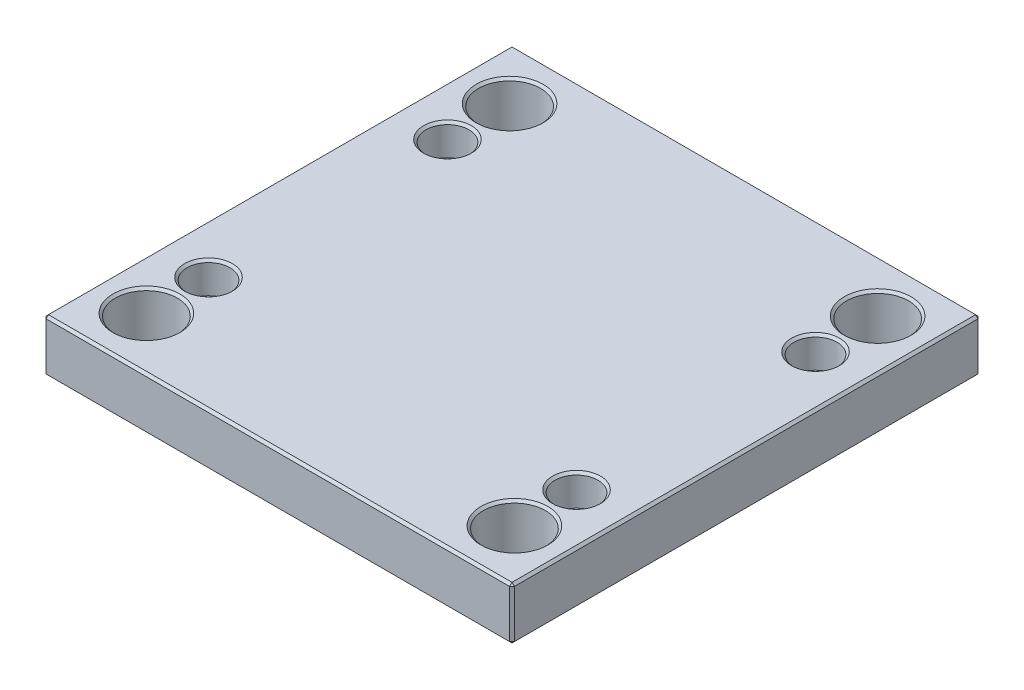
ISO-10303-21;
HEADER;
FILE_DESCRIPTION(('STEP AP214'),'2;1');
FILE_NAME('part.step','',(''),(''),'','','');
FILE_SCHEMA(('AUTOMOTIVE_DESIGN { 1 0 10303 214 1 1 1 1 }'));
ENDSEC;
DATA;
#1=APPLICATION_CONTEXT('core data for automotive mechanical design processes');
#2=APPLICATION_PROTOCOL_DEFINITION('international standard','automotive_design',2000,#1);
#3=PRODUCT_CONTEXT('',#1,'mechanical');
#4=PRODUCT('Part','Part','',(#3));
#5=PRODUCT_RELATED_PRODUCT_CATEGORY('part','',(#4));
#6=PRODUCT_DEFINITION_FORMATION('','',#4);
#7=PRODUCT_DEFINITION_CONTEXT('part definition',#1,'design');
#8=PRODUCT_DEFINITION('design','',#6,#7);
#9=PRODUCT_DEFINITION_SHAPE('','',#8);
#10=(LENGTH_UNIT() NAMED_UNIT(*) SI_UNIT(.MILLI.,.METRE.));
#11=(NAMED_UNIT(*) PLANE_ANGLE_UNIT() SI_UNIT($,.RADIAN.));
#12=(NAMED_UNIT(*) SI_UNIT($,.STERADIAN.) SOLID_ANGLE_UNIT());
#13=UNCERTAINTY_MEASURE_WITH_UNIT(LENGTH_MEASURE(1.E-05),#10,'distance_accuracy_value','');
#14=(GEOMETRIC_REPRESENTATION_CONTEXT(3) GLOBAL_UNCERTAINTY_ASSIGNED_CONTEXT((#13)) GLOBAL_UNIT_ASSIGNED_CONTEXT((#10,
#11,#12)) REPRESENTATION_CONTEXT('',''));
#15=CARTESIAN_POINT('',(0.,0.,0.));
#16=DIRECTION('',(0.,0.,1.));
#17=DIRECTION('',(1.,0.,0.));
#18=AXIS2_PLACEMENT_3D('',#15,#16,#17);
#19=CARTESIAN_POINT('',(-98.,22.,98.));
#20=DIRECTION('',(1.,0.,0.));
#21=DIRECTION('',(0.,0.,-1.));
#22=AXIS2_PLACEMENT_3D('',#19,#20,#21);
#23=PLANE('',#22);
#24=DIRECTION('',(0.,-1.,0.));
#25=VECTOR('',#24,1.);
#26=CARTESIAN_POINT('',(-98.,22.,-97.));
#27=LINE('',#26,#25);
#28=CARTESIAN_POINT('',(-98.,21.,-97.));
#29=VERTEX_POINT('',#28);
#30=CARTESIAN_POINT('',(-98.,1.00000000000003,-97.));
#31=VERTEX_POINT('',#30);
#32=EDGE_CURVE('E114',#29,#31,#27,.T.);
#33=ORIENTED_EDGE('',*,*,#32,.T.);
#34=DIRECTION('',(0.,0.,1.));
#35=VECTOR('',#34,1.);
#36=CARTESIAN_POINT('',(-98.,1.00000000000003,98.));
#37=LINE('',#36,#35);
#38=CARTESIAN_POINT('',(-98.,1.00000000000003,97.));
#39=VERTEX_POINT('',#38);
#40=EDGE_CURVE('E110',#31,#39,#37,.T.);
#41=ORIENTED_EDGE('',*,*,#40,.T.);
#42=DIRECTION('',(0.,1.,0.));
#43=VECTOR('',#42,1.);
#44=CARTESIAN_POINT('',(-98.,22.,97.));
#45=LINE('',#44,#43);
#46=CARTESIAN_POINT('',(-98.,21.,97.));
#47=VERTEX_POINT('',#46);
#48=EDGE_CURVE('E103',#39,#47,#45,.T.);
#49=ORIENTED_EDGE('',*,*,#48,.T.);
#50=DIRECTION('',(0.,0.,-1.));
#51=VECTOR('',#50,1.);
#52=CARTESIAN_POINT('',(-98.,21.,-98.));
#53=LINE('',#52,#51);
#54=EDGE_CURVE('E107',#47,#29,#53,.T.);
#55=ORIENTED_EDGE('',*,*,#54,.T.);
#56=EDGE_LOOP('',(#33,#41,#49,#55));
#57=FACE_BOUND('',#56,.T.);
#58=ADVANCED_FACE('F15',(#57),#23,.F.);
#59=CARTESIAN_POINT('',(98.,22.,98.));
#60=DIRECTION('',(0.,0.,-1.));
#61=DIRECTION('',(-1.,0.,0.));
#62=AXIS2_PLACEMENT_3D('',#59,#60,#61);
#63=PLANE('',#62);
#64=DIRECTION('',(-1.,0.,0.));
#65=VECTOR('',#64,1.);
#66=CARTESIAN_POINT('',(-98.,21.,98.));
#67=LINE('',#66,#65);
#68=CARTESIAN_POINT('',(97.,21.,98.));
#69=VERTEX_POINT('',#68);
#70=CARTESIAN_POINT('',(-97.,21.,98.));
#71=VERTEX_POINT('',#70);
#72=EDGE_CURVE('E169',#69,#71,#67,.T.);
#73=ORIENTED_EDGE('',*,*,#72,.T.);
#74=DIRECTION('',(0.,-1.,0.));
#75=VECTOR('',#74,1.);
#76=CARTESIAN_POINT('',(-97.,22.,98.));
#77=LINE('',#76,#75);
#78=CARTESIAN_POINT('',(-97.,1.00000000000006,98.));
#79=VERTEX_POINT('',#78);
#80=EDGE_CURVE('E122',#71,#79,#77,.T.);
#81=ORIENTED_EDGE('',*,*,#80,.T.);
#82=DIRECTION('',(1.,0.,0.));
#83=VECTOR('',#82,1.);
#84=CARTESIAN_POINT('',(98.,1.00000000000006,98.));
#85=LINE('',#84,#83);
#86=CARTESIAN_POINT('',(97.,1.00000000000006,98.));
#87=VERTEX_POINT('',#86);
#88=EDGE_CURVE('E173',#79,#87,#85,.T.);
#89=ORIENTED_EDGE('',*,*,#88,.T.);
#90=DIRECTION('',(0.,1.,0.));
#91=VECTOR('',#90,1.);
#92=CARTESIAN_POINT('',(97.,22.,98.));
#93=LINE('',#92,#91);
#94=EDGE_CURVE('E171',#87,#69,#93,.T.);
#95=ORIENTED_EDGE('',*,*,#94,.T.);
#96=EDGE_LOOP('',(#73,#81,#89,#95));
#97=FACE_BOUND('',#96,.T.);
#98=ADVANCED_FACE('F412',(#97),#63,.F.);
#99=CARTESIAN_POINT('',(98.,22.,98.));
#100=DIRECTION('',(-1.,0.,0.));
#101=DIRECTION('',(0.,0.,1.));
#102=AXIS2_PLACEMENT_3D('',#99,#100,#101);
#103=PLANE('',#102);
#104=DIRECTION('',(0.,0.,-1.));
#105=VECTOR('',#104,1.);
#106=CARTESIAN_POINT('',(98.,1.00000000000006,98.));
#107=LINE('',#106,#105);
#108=CARTESIAN_POINT('',(98.,1.00000000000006,97.));
#109=VERTEX_POINT('',#108);
#110=CARTESIAN_POINT('',(98.,1.00000000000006,-97.));
#111=VERTEX_POINT('',#110);
#112=EDGE_CURVE('E164',#109,#111,#107,.T.);
#113=ORIENTED_EDGE('',*,*,#112,.T.);
#114=DIRECTION('',(0.,1.,0.));
#115=VECTOR('',#114,1.);
#116=CARTESIAN_POINT('',(98.,22.,-97.));
#117=LINE('',#116,#115);
#118=CARTESIAN_POINT('',(98.,21.,-97.));
#119=VERTEX_POINT('',#118);
#120=EDGE_CURVE('E166',#111,#119,#117,.T.);
#121=ORIENTED_EDGE('',*,*,#120,.T.);
#122=DIRECTION('',(0.,0.,1.));
#123=VECTOR('',#122,1.);
#124=CARTESIAN_POINT('',(98.,21.,98.));
#125=LINE('',#124,#123);
#126=CARTESIAN_POINT('',(98.,21.,97.));
#127=VERTEX_POINT('',#126);
#128=EDGE_CURVE('E160',#119,#127,#125,.T.);
#129=ORIENTED_EDGE('',*,*,#128,.T.);
#130=DIRECTION('',(0.,-1.,0.));
#131=VECTOR('',#130,1.);
#132=CARTESIAN_POINT('',(98.,22.,97.));
#133=LINE('',#132,#131);
#134=EDGE_CURVE('E162',#127,#109,#133,.T.);
#135=ORIENTED_EDGE('',*,*,#134,.T.);
#136=EDGE_LOOP('',(#113,#121,#129,#135));
#137=FACE_BOUND('',#136,.T.);
#138=ADVANCED_FACE('F405',(#137),#103,.F.);
#139=CARTESIAN_POINT('',(98.,22.,-98.));
#140=DIRECTION('',(0.,0.,1.));
#141=DIRECTION('',(1.,0.,0.));
#142=AXIS2_PLACEMENT_3D('',#139,#140,#141);
#143=PLANE('',#142);
#144=DIRECTION('',(0.,-1.,0.));
#145=VECTOR('',#144,1.);
#146=CARTESIAN_POINT('',(97.,22.,-98.));
#147=LINE('',#146,#145);
#148=CARTESIAN_POINT('',(97.,21.,-98.));
#149=VERTEX_POINT('',#148);
#150=CARTESIAN_POINT('',(97.,1.00000000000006,-98.));
#151=VERTEX_POINT('',#150);
#152=EDGE_CURVE('E153',#149,#151,#147,.T.);
#153=ORIENTED_EDGE('',*,*,#152,.T.);
#154=DIRECTION('',(-1.,0.,0.));
#155=VECTOR('',#154,1.);
#156=CARTESIAN_POINT('',(98.,1.00000000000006,-98.));
#157=LINE('',#156,#155);
#158=CARTESIAN_POINT('',(-97.,1.00000000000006,-98.));
#159=VERTEX_POINT('',#158);
#160=EDGE_CURVE('E158',#151,#159,#157,.T.);
#161=ORIENTED_EDGE('',*,*,#160,.T.);
#162=DIRECTION('',(0.,1.,0.));
#163=VECTOR('',#162,1.);
#164=CARTESIAN_POINT('',(-97.,22.,-98.));
#165=LINE('',#164,#163);
#166=CARTESIAN_POINT('',(-97.,21.,-98.));
#167=VERTEX_POINT('',#166);
#168=EDGE_CURVE('E155',#159,#167,#165,.T.);
#169=ORIENTED_EDGE('',*,*,#168,.T.);
#170=DIRECTION('',(1.,0.,0.));
#171=VECTOR('',#170,1.);
#172=CARTESIAN_POINT('',(98.,21.,-98.));
#173=LINE('',#172,#171);
#174=EDGE_CURVE('E151',#167,#149,#173,.T.);
#175=ORIENTED_EDGE('',*,*,#174,.T.);
#176=EDGE_LOOP('',(#153,#161,#169,#175));
#177=FACE_BOUND('',#176,.T.);
#178=ADVANCED_FACE('F430',(#177),#143,.F.);
#179=CARTESIAN_POINT('',(0.,22.,0.));
#180=DIRECTION('',(0.,1.,0.));
#181=DIRECTION('',(0.,0.,1.));
#182=AXIS2_PLACEMENT_3D('',#179,#180,#181);
#183=PLANE('',#182);
#184=CARTESIAN_POINT('',(-77.,22.,76.));
#185=DIRECTION('',(0.,1.,0.));
#186=DIRECTION('',(0.,0.,1.));
#187=AXIS2_PLACEMENT_3D('',#184,#185,#186);
#188=CIRCLE('',#187,14.);
#189=CARTESIAN_POINT('',(-77.,22.,90.));
#190=VERTEX_POINT('',#189);
#191=EDGE_CURVE('E316',#190,#190,#188,.F.);
#192=ORIENTED_EDGE('',*,*,#191,.T.);
#193=EDGE_LOOP('',(#192));
#194=FACE_BOUND('',#193,.T.);
#195=CARTESIAN_POINT('',(77.,22.,76.));
#196=DIRECTION('',(0.,1.,0.));
#197=DIRECTION('',(0.,0.,1.));
#198=AXIS2_PLACEMENT_3D('',#195,#196,#197);
#199=CIRCLE('',#198,14.);
#200=CARTESIAN_POINT('',(77.,22.,90.));
#201=VERTEX_POINT('',#200);
#202=EDGE_CURVE('E313',#201,#201,#199,.F.);
#203=ORIENTED_EDGE('',*,*,#202,.T.);
#204=EDGE_LOOP('',(#203));
#205=FACE_BOUND('',#204,.T.);
#206=CARTESIAN_POINT('',(77.,22.,-76.));
#207=DIRECTION('',(0.,1.,0.));
#208=DIRECTION('',(0.,0.,1.));
#209=AXIS2_PLACEMENT_3D('',#206,#207,#208);
#210=CIRCLE('',#209,14.);
#211=CARTESIAN_POINT('',(77.,22.,-62.));
#212=VERTEX_POINT('',#211);
#213=EDGE_CURVE('E310',#212,#212,#210,.F.);
#214=ORIENTED_EDGE('',*,*,#213,.T.);
#215=EDGE_LOOP('',(#214));
#216=FACE_BOUND('',#215,.T.);
#217=CARTESIAN_POINT('',(-77.,22.,-76.));
#218=DIRECTION('',(0.,1.,0.));
#219=DIRECTION('',(0.,0.,1.));
#220=AXIS2_PLACEMENT_3D('',#217,#218,#219);
#221=CIRCLE('',#220,14.);
#222=CARTESIAN_POINT('',(-77.,22.,-62.));
#223=VERTEX_POINT('',#222);
#224=EDGE_CURVE('E307',#223,#223,#221,.F.);
#225=ORIENTED_EDGE('',*,*,#224,.T.);
#226=EDGE_LOOP('',(#225));
#227=FACE_BOUND('',#226,.T.);
#228=CARTESIAN_POINT('',(-77.,22.,50.));
#229=DIRECTION('',(0.,1.,0.));
#230=DIRECTION('',(0.,0.,1.));
#231=AXIS2_PLACEMENT_3D('',#228,#229,#230);
#232=CIRCLE('',#231,10.);
#233=CARTESIAN_POINT('',(-77.,22.,60.));
#234=VERTEX_POINT('',#233);
#235=EDGE_CURVE('E289',#234,#234,#232,.F.);
#236=ORIENTED_EDGE('',*,*,#235,.T.);
#237=EDGE_LOOP('',(#236));
#238=FACE_BOUND('',#237,.T.);
#239=CARTESIAN_POINT('',(77.,22.,50.));
#240=DIRECTION('',(0.,1.,0.));
#241=DIRECTION('',(0.,0.,1.));
#242=AXIS2_PLACEMENT_3D('',#239,#240,#241);
#243=CIRCLE('',#242,10.);
#244=CARTESIAN_POINT('',(77.,22.,60.));
#245=VERTEX_POINT('',#244);
#246=EDGE_CURVE('E286',#245,#245,#243,.F.);
#247=ORIENTED_EDGE('',*,*,#246,.T.);
#248=EDGE_LOOP('',(#247));
#249=FACE_BOUND('',#248,.T.);
#250=CARTESIAN_POINT('',(77.,22.,-50.));
#251=DIRECTION('',(0.,1.,0.));
#252=DIRECTION('',(0.,0.,1.));
#253=AXIS2_PLACEMENT_3D('',#250,#251,#252);
#254=CIRCLE('',#253,10.);
#255=CARTESIAN_POINT('',(77.,22.,-40.));
#256=VERTEX_POINT('',#255);
#257=EDGE_CURVE('E283',#256,#256,#254,.F.);
#258=ORIENTED_EDGE('',*,*,#257,.T.);
#259=EDGE_LOOP('',(#258));
#260=FACE_BOUND('',#259,.T.);
#261=CARTESIAN_POINT('',(-77.,22.,-50.));
#262=DIRECTION('',(0.,1.,0.));
#263=DIRECTION('',(0.,0.,1.));
#264=AXIS2_PLACEMENT_3D('',#261,#262,#263);
#265=CIRCLE('',#264,10.);
#266=CARTESIAN_POINT('',(-77.,22.,-40.));
#267=VERTEX_POINT('',#266);
#268=EDGE_CURVE('E280',#267,#267,#265,.F.);
#269=ORIENTED_EDGE('',*,*,#268,.T.);
#270=EDGE_LOOP('',(#269));
#271=FACE_BOUND('',#270,.T.);
#272=DIRECTION('',(0.,0.,-1.));
#273=VECTOR('',#272,1.);
#274=CARTESIAN_POINT('',(97.,22.,-98.));
#275=LINE('',#274,#273);
#276=CARTESIAN_POINT('',(97.,22.,97.));
#277=VERTEX_POINT('',#276);
#278=CARTESIAN_POINT('',(97.,22.,-97.));
#279=VERTEX_POINT('',#278);
#280=EDGE_CURVE('E30',#277,#279,#275,.T.);
#281=ORIENTED_EDGE('',*,*,#280,.T.);
#282=DIRECTION('',(-1.,0.,0.));
#283=VECTOR('',#282,1.);
#284=CARTESIAN_POINT('',(-98.,22.,-97.));
#285=LINE('',#284,#283);
#286=CARTESIAN_POINT('',(-97.,22.,-97.));
#287=VERTEX_POINT('',#286);
#288=EDGE_CURVE('E189',#279,#287,#285,.T.);
#289=ORIENTED_EDGE('',*,*,#288,.T.);
#290=DIRECTION('',(0.,0.,1.));
#291=VECTOR('',#290,1.);
#292=CARTESIAN_POINT('',(-97.,22.,98.));
#293=LINE('',#292,#291);
#294=CARTESIAN_POINT('',(-97.,22.,97.));
#295=VERTEX_POINT('',#294);
#296=EDGE_CURVE('E185',#287,#295,#293,.T.);
#297=ORIENTED_EDGE('',*,*,#296,.T.);
#298=DIRECTION('',(1.,0.,0.));
#299=VECTOR('',#298,1.);
#300=CARTESIAN_POINT('',(98.,22.,97.));
#301=LINE('',#300,#299);
#302=EDGE_CURVE('E35',#295,#277,#301,.T.);
#303=ORIENTED_EDGE('',*,*,#302,.T.);
#304=EDGE_LOOP('',(#281,#289,#297,#303));
#305=FACE_BOUND('',#304,.T.);
#306=ADVANCED_FACE('F356',(#194,#205,#216,#227,#238,#249,#260,#271,#305),#183,.T.);
#307=CARTESIAN_POINT('',(0.,0.,0.));
#308=DIRECTION('',(0.,1.,0.));
#309=DIRECTION('',(0.,0.,1.));
#310=AXIS2_PLACEMENT_3D('',#307,#308,#309);
#311=PLANE('',#310);
#312=CARTESIAN_POINT('',(-77.,0.,76.));
#313=DIRECTION('',(0.,1.,0.));
#314=DIRECTION('',(0.,0.,1.));
#315=AXIS2_PLACEMENT_3D('',#312,#313,#314);
#316=CIRCLE('',#315,14.);
#317=CARTESIAN_POINT('',(-77.,0.,90.));
#318=VERTEX_POINT('',#317);
#319=EDGE_CURVE('E328',#318,#318,#316,.T.);
#320=ORIENTED_EDGE('',*,*,#319,.T.);
#321=EDGE_LOOP('',(#320));
#322=FACE_BOUND('',#321,.T.);
#323=CARTESIAN_POINT('',(77.,0.,76.));
#324=DIRECTION('',(0.,1.,0.));
#325=DIRECTION('',(0.,0.,1.));
#326=AXIS2_PLACEMENT_3D('',#323,#324,#325);
#327=CIRCLE('',#326,14.);
#328=CARTESIAN_POINT('',(77.,0.,90.));
#329=VERTEX_POINT('',#328);
#330=EDGE_CURVE('E325',#329,#329,#327,.T.);
#331=ORIENTED_EDGE('',*,*,#330,.T.);
#332=EDGE_LOOP('',(#331));
#333=FACE_BOUND('',#332,.T.);
#334=CARTESIAN_POINT('',(77.,0.,-76.));
#335=DIRECTION('',(0.,1.,0.));
#336=DIRECTION('',(0.,0.,1.));
#337=AXIS2_PLACEMENT_3D('',#334,#335,#336);
#338=CIRCLE('',#337,14.);
#339=CARTESIAN_POINT('',(77.,0.,-62.));
#340=VERTEX_POINT('',#339);
#341=EDGE_CURVE('E322',#340,#340,#338,.T.);
#342=ORIENTED_EDGE('',*,*,#341,.T.);
#343=EDGE_LOOP('',(#342));
#344=FACE_BOUND('',#343,.T.);
#345=CARTESIAN_POINT('',(-77.,0.,-76.));
#346=DIRECTION('',(0.,1.,0.));
#347=DIRECTION('',(0.,0.,1.));
#348=AXIS2_PLACEMENT_3D('',#345,#346,#347);
#349=CIRCLE('',#348,14.);
#350=CARTESIAN_POINT('',(-77.,0.,-62.));
#351=VERTEX_POINT('',#350);
#352=EDGE_CURVE('E319',#351,#351,#349,.T.);
#353=ORIENTED_EDGE('',*,*,#352,.T.);
#354=EDGE_LOOP('',(#353));
#355=FACE_BOUND('',#354,.T.);
#356=CARTESIAN_POINT('',(77.,0.,-50.));
#357=DIRECTION('',(0.,1.,0.));
#358=DIRECTION('',(0.,0.,1.));
#359=AXIS2_PLACEMENT_3D('',#356,#357,#358);
#360=CIRCLE('',#359,6.5);
#361=CARTESIAN_POINT('',(77.,0.,-43.5));
#362=VERTEX_POINT('',#361);
#363=EDGE_CURVE('E262',#362,#362,#360,.T.);
#364=ORIENTED_EDGE('',*,*,#363,.T.);
#365=EDGE_LOOP('',(#364));
#366=FACE_BOUND('',#365,.T.);
#367=CARTESIAN_POINT('',(77.,0.,50.));
#368=DIRECTION('',(0.,1.,0.));
#369=DIRECTION('',(0.,0.,1.));
#370=AXIS2_PLACEMENT_3D('',#367,#368,#369);
#371=CIRCLE('',#370,6.5);
#372=CARTESIAN_POINT('',(77.,0.,56.5));
#373=VERTEX_POINT('',#372);
#374=EDGE_CURVE('E259',#373,#373,#371,.T.);
#375=ORIENTED_EDGE('',*,*,#374,.T.);
#376=EDGE_LOOP('',(#375));
#377=FACE_BOUND('',#376,.T.);
#378=CARTESIAN_POINT('',(-77.,0.,50.));
#379=DIRECTION('',(0.,1.,0.));
#380=DIRECTION('',(0.,0.,1.));
#381=AXIS2_PLACEMENT_3D('',#378,#379,#380);
#382=CIRCLE('',#381,6.5);
#383=CARTESIAN_POINT('',(-77.,0.,56.5));
#384=VERTEX_POINT('',#383);
#385=EDGE_CURVE('E256',#384,#384,#382,.T.);
#386=ORIENTED_EDGE('',*,*,#385,.T.);
#387=EDGE_LOOP('',(#386));
#388=FACE_BOUND('',#387,.T.);
#389=CARTESIAN_POINT('',(-77.,0.,-50.));
#390=DIRECTION('',(0.,1.,0.));
#391=DIRECTION('',(0.,0.,1.));
#392=AXIS2_PLACEMENT_3D('',#389,#390,#391);
#393=CIRCLE('',#392,6.5);
#394=CARTESIAN_POINT('',(-77.,0.,-43.5));
#395=VERTEX_POINT('',#394);
#396=EDGE_CURVE('E191',#395,#395,#393,.T.);
#397=ORIENTED_EDGE('',*,*,#396,.T.);
#398=EDGE_LOOP('',(#397));
#399=FACE_BOUND('',#398,.T.);
#400=DIRECTION('',(0.,0.,1.));
#401=VECTOR('',#400,1.);
#402=CARTESIAN_POINT('',(97.,0.,0.));
#403=LINE('',#402,#401);
#404=CARTESIAN_POINT('',(97.,0.,-97.));
#405=VERTEX_POINT('',#404);
#406=CARTESIAN_POINT('',(97.,0.,97.));
#407=VERTEX_POINT('',#406);
#408=EDGE_CURVE('E176',#405,#407,#403,.T.);
#409=ORIENTED_EDGE('',*,*,#408,.T.);
#410=DIRECTION('',(-1.,0.,0.));
#411=VECTOR('',#410,1.);
#412=CARTESIAN_POINT('',(0.,0.,97.));
#413=LINE('',#412,#411);
#414=CARTESIAN_POINT('',(-97.,0.,97.));
#415=VERTEX_POINT('',#414);
#416=EDGE_CURVE('E182',#407,#415,#413,.T.);
#417=ORIENTED_EDGE('',*,*,#416,.T.);
#418=DIRECTION('',(0.,0.,-1.));
#419=VECTOR('',#418,1.);
#420=CARTESIAN_POINT('',(-97.,0.,0.));
#421=LINE('',#420,#419);
#422=CARTESIAN_POINT('',(-97.,0.,-97.));
#423=VERTEX_POINT('',#422);
#424=EDGE_CURVE('E180',#415,#423,#421,.T.);
#425=ORIENTED_EDGE('',*,*,#424,.T.);
#426=DIRECTION('',(1.,0.,0.));
#427=VECTOR('',#426,1.);
#428=CARTESIAN_POINT('',(0.,0.,-97.));
#429=LINE('',#428,#427);
#430=EDGE_CURVE('E178',#423,#405,#429,.T.);
#431=ORIENTED_EDGE('',*,*,#430,.T.);
#432=EDGE_LOOP('',(#409,#417,#425,#431));
#433=FACE_BOUND('',#432,.T.);
#434=ADVANCED_FACE('F352',(#322,#333,#344,#355,#366,#377,#388,#399,#433),#311,.F.);
#435=CARTESIAN_POINT('',(98.,22.,97.));
#436=DIRECTION('',(-0.707106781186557,0.,-0.707106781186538));
#437=DIRECTION('',(0.,-1.,0.));
#438=AXIS2_PLACEMENT_3D('',#435,#436,#437);
#439=PLANE('',#438);
#440=DIRECTION('',(-0.707106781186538,0.,0.707106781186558));
#441=VECTOR('',#440,1.);
#442=CARTESIAN_POINT('',(97.,21.,98.));
#443=LINE('',#442,#441);
#444=EDGE_CURVE('E140',#69,#127,#443,.F.);
#445=ORIENTED_EDGE('',*,*,#444,.F.);
#446=ORIENTED_EDGE('',*,*,#94,.F.);
#447=DIRECTION('',(0.707106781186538,0.,-0.707106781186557));
#448=VECTOR('',#447,1.);
#449=CARTESIAN_POINT('',(97.,1.00000000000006,98.));
#450=LINE('',#449,#448);
#451=EDGE_CURVE('E143',#109,#87,#450,.F.);
#452=ORIENTED_EDGE('',*,*,#451,.F.);
#453=ORIENTED_EDGE('',*,*,#134,.F.);
#454=EDGE_LOOP('',(#445,#446,#452,#453));
#455=FACE_BOUND('',#454,.T.);
#456=ADVANCED_FACE('F355',(#455),#439,.F.);
#457=CARTESIAN_POINT('',(97.,21.,98.));
#458=DIRECTION('',(0.577350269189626,0.577350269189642,0.57735026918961));
#459=DIRECTION('',(-0.707106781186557,0.707106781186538,0.));
#460=AXIS2_PLACEMENT_3D('',#457,#458,#459);
#461=PLANE('',#460);
#462=DIRECTION('',(0.,-0.707106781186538,0.707106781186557));
#463=VECTOR('',#462,1.);
#464=CARTESIAN_POINT('',(97.,21.,98.));
#465=LINE('',#464,#463);
#466=EDGE_CURVE('E234',#69,#277,#465,.F.);
#467=ORIENTED_EDGE('',*,*,#466,.F.);
#468=ORIENTED_EDGE('',*,*,#444,.T.);
#469=DIRECTION('',(-0.707106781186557,0.707106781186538,0.));
#470=VECTOR('',#469,1.);
#471=CARTESIAN_POINT('',(97.5,21.5,97.));
#472=LINE('',#471,#470);
#473=EDGE_CURVE('E236',#277,#127,#472,.F.);
#474=ORIENTED_EDGE('',*,*,#473,.F.);
#475=EDGE_LOOP('',(#467,#468,#474));
#476=FACE_BOUND('',#475,.T.);
#477=ADVANCED_FACE('F418',(#476),#461,.T.);
#478=CARTESIAN_POINT('',(97.,1.00000000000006,98.));
#479=DIRECTION('',(0.577350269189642,-0.57735026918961,0.577350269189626));
#480=DIRECTION('',(0.707106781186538,0.,-0.707106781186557));
#481=AXIS2_PLACEMENT_3D('',#478,#479,#480);
#482=PLANE('',#481);
#483=DIRECTION('',(-0.707106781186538,-0.707106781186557,0.));
#484=VECTOR('',#483,1.);
#485=CARTESIAN_POINT('',(97.5,0.500000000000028,97.));
#486=LINE('',#485,#484);
#487=EDGE_CURVE('E228',#109,#407,#486,.T.);
#488=ORIENTED_EDGE('',*,*,#487,.F.);
#489=ORIENTED_EDGE('',*,*,#451,.T.);
#490=DIRECTION('',(0.,0.707106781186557,0.707106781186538));
#491=VECTOR('',#490,1.);
#492=CARTESIAN_POINT('',(97.,1.00000000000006,98.));
#493=LINE('',#492,#491);
#494=EDGE_CURVE('E231',#407,#87,#493,.T.);
#495=ORIENTED_EDGE('',*,*,#494,.F.);
#496=EDGE_LOOP('',(#488,#489,#495));
#497=FACE_BOUND('',#496,.T.);
#498=ADVANCED_FACE('F377',(#497),#482,.T.);
#499=CARTESIAN_POINT('',(97.,22.,0.));
#500=DIRECTION('',(0.707106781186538,0.707106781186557,0.));
#501=DIRECTION('',(0.,0.,1.));
#502=AXIS2_PLACEMENT_3D('',#499,#500,#501);
#503=PLANE('',#502);
#504=ORIENTED_EDGE('',*,*,#473,.T.);
#505=ORIENTED_EDGE('',*,*,#128,.F.);
#506=DIRECTION('',(0.707106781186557,-0.707106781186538,0.));
#507=VECTOR('',#506,1.);
#508=CARTESIAN_POINT('',(98.,21.,-97.));
#509=LINE('',#508,#507);
#510=EDGE_CURVE('E223',#279,#119,#509,.T.);
#511=ORIENTED_EDGE('',*,*,#510,.F.);
#512=ORIENTED_EDGE('',*,*,#280,.F.);
#513=EDGE_LOOP('',(#504,#505,#511,#512));
#514=FACE_BOUND('',#513,.T.);
#515=ADVANCED_FACE('F420',(#514),#503,.T.);
#516=CARTESIAN_POINT('',(0.,22.,97.));
#517=DIRECTION('',(0.,0.707106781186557,0.707106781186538));
#518=DIRECTION('',(-1.,0.,0.));
#519=AXIS2_PLACEMENT_3D('',#516,#517,#518);
#520=PLANE('',#519);
#521=ORIENTED_EDGE('',*,*,#466,.T.);
#522=ORIENTED_EDGE('',*,*,#302,.F.);
#523=DIRECTION('',(0.,0.707106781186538,-0.707106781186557));
#524=VECTOR('',#523,1.);
#525=CARTESIAN_POINT('',(-97.,21.5,97.5));
#526=LINE('',#525,#524);
#527=EDGE_CURVE('E126',#71,#295,#526,.T.);
#528=ORIENTED_EDGE('',*,*,#527,.F.);
#529=ORIENTED_EDGE('',*,*,#72,.F.);
#530=EDGE_LOOP('',(#521,#522,#528,#529));
#531=FACE_BOUND('',#530,.T.);
#532=ADVANCED_FACE('F415',(#531),#520,.T.);
#533=CARTESIAN_POINT('',(-97.,22.,98.));
#534=DIRECTION('',(0.707106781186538,0.,-0.707106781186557));
#535=DIRECTION('',(0.,-1.,0.));
#536=AXIS2_PLACEMENT_3D('',#533,#534,#535);
#537=PLANE('',#536);
#538=DIRECTION('',(0.707106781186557,0.,0.707106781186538));
#539=VECTOR('',#538,1.);
#540=CARTESIAN_POINT('',(-97.,1.00000000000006,98.));
#541=LINE('',#540,#539);
#542=EDGE_CURVE('E127',#79,#39,#541,.F.);
#543=ORIENTED_EDGE('',*,*,#542,.F.);
#544=ORIENTED_EDGE('',*,*,#80,.F.);
#545=DIRECTION('',(-0.707106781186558,0.,-0.707106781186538));
#546=VECTOR('',#545,1.);
#547=CARTESIAN_POINT('',(-98.,21.,97.));
#548=LINE('',#547,#546);
#549=EDGE_CURVE('E118',#47,#71,#548,.F.);
#550=ORIENTED_EDGE('',*,*,#549,.F.);
#551=ORIENTED_EDGE('',*,*,#48,.F.);
#552=EDGE_LOOP('',(#543,#544,#550,#551));
#553=FACE_BOUND('',#552,.T.);
#554=ADVANCED_FACE('F120',(#553),#537,.F.);
#555=CARTESIAN_POINT('',(98.,1.00000000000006,98.));
#556=DIRECTION('',(0.,0.707106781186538,-0.707106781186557));
#557=DIRECTION('',(1.,0.,0.));
#558=AXIS2_PLACEMENT_3D('',#555,#556,#557);
#559=PLANE('',#558);
#560=ORIENTED_EDGE('',*,*,#494,.T.);
#561=ORIENTED_EDGE('',*,*,#88,.F.);
#562=DIRECTION('',(0.,-0.707106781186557,-0.707106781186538));
#563=VECTOR('',#562,1.);
#564=CARTESIAN_POINT('',(-97.,1.00000000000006,98.));
#565=LINE('',#564,#563);
#566=EDGE_CURVE('E219',#415,#79,#565,.F.);
#567=ORIENTED_EDGE('',*,*,#566,.F.);
#568=ORIENTED_EDGE('',*,*,#416,.F.);
#569=EDGE_LOOP('',(#560,#561,#567,#568));
#570=FACE_BOUND('',#569,.T.);
#571=ADVANCED_FACE('F382',(#570),#559,.F.);
#572=CARTESIAN_POINT('',(98.,1.00000000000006,98.));
#573=DIRECTION('',(-0.707106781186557,0.707106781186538,0.));
#574=DIRECTION('',(0.,0.,-1.));
#575=AXIS2_PLACEMENT_3D('',#572,#573,#574);
#576=PLANE('',#575);
#577=ORIENTED_EDGE('',*,*,#487,.T.);
#578=ORIENTED_EDGE('',*,*,#408,.F.);
#579=DIRECTION('',(0.707106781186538,0.707106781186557,0.));
#580=VECTOR('',#579,1.);
#581=CARTESIAN_POINT('',(97.5,0.500000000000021,-97.));
#582=LINE('',#581,#580);
#583=EDGE_CURVE('E216',#111,#405,#582,.F.);
#584=ORIENTED_EDGE('',*,*,#583,.F.);
#585=ORIENTED_EDGE('',*,*,#112,.F.);
#586=EDGE_LOOP('',(#577,#578,#584,#585));
#587=FACE_BOUND('',#586,.T.);
#588=ADVANCED_FACE('F375',(#587),#576,.F.);
#589=CARTESIAN_POINT('',(97.,22.,-98.));
#590=DIRECTION('',(-0.707106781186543,0.,0.707106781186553));
#591=DIRECTION('',(0.,-1.,0.));
#592=AXIS2_PLACEMENT_3D('',#589,#590,#591);
#593=PLANE('',#592);
#594=DIRECTION('',(0.707106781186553,0.,0.707106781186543));
#595=VECTOR('',#594,1.);
#596=CARTESIAN_POINT('',(98.,21.,-97.));
#597=LINE('',#596,#595);
#598=EDGE_CURVE('E225',#119,#149,#597,.F.);
#599=ORIENTED_EDGE('',*,*,#598,.F.);
#600=ORIENTED_EDGE('',*,*,#120,.F.);
#601=DIRECTION('',(-0.707106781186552,0.,-0.707106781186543));
#602=VECTOR('',#601,1.);
#603=CARTESIAN_POINT('',(97.,1.00000000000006,-98.));
#604=LINE('',#603,#602);
#605=EDGE_CURVE('E213',#151,#111,#604,.F.);
#606=ORIENTED_EDGE('',*,*,#605,.F.);
#607=ORIENTED_EDGE('',*,*,#152,.F.);
#608=EDGE_LOOP('',(#599,#600,#606,#607));
#609=FACE_BOUND('',#608,.T.);
#610=ADVANCED_FACE('F402',(#609),#593,.F.);
#611=CARTESIAN_POINT('',(98.,21.,-97.));
#612=DIRECTION('',(0.577350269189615,0.577350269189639,-0.577350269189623));
#613=DIRECTION('',(0.,0.707106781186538,0.707106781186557));
#614=AXIS2_PLACEMENT_3D('',#611,#612,#613);
#615=PLANE('',#614);
#616=ORIENTED_EDGE('',*,*,#510,.T.);
#617=ORIENTED_EDGE('',*,*,#598,.T.);
#618=DIRECTION('',(0.,0.70710678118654,0.707106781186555));
#619=VECTOR('',#618,1.);
#620=CARTESIAN_POINT('',(97.,21.5,-97.5));
#621=LINE('',#620,#619);
#622=EDGE_CURVE('E134',#279,#149,#621,.F.);
#623=ORIENTED_EDGE('',*,*,#622,.F.);
#624=EDGE_LOOP('',(#616,#617,#623));
#625=FACE_BOUND('',#624,.T.);
#626=ADVANCED_FACE('F424',(#625),#615,.T.);
#627=CARTESIAN_POINT('',(-98.,21.,97.));
#628=DIRECTION('',(-0.57735026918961,0.577350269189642,0.577350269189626));
#629=DIRECTION('',(0.,-0.707106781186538,0.707106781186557));
#630=AXIS2_PLACEMENT_3D('',#627,#628,#629);
#631=PLANE('',#630);
#632=ORIENTED_EDGE('',*,*,#549,.T.);
#633=ORIENTED_EDGE('',*,*,#527,.T.);
#634=DIRECTION('',(-0.707106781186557,-0.707106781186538,0.));
#635=VECTOR('',#634,1.);
#636=CARTESIAN_POINT('',(-98.,21.,97.));
#637=LINE('',#636,#635);
#638=EDGE_CURVE('E130',#47,#295,#637,.F.);
#639=ORIENTED_EDGE('',*,*,#638,.F.);
#640=EDGE_LOOP('',(#632,#633,#639));
#641=FACE_BOUND('',#640,.T.);
#642=ADVANCED_FACE('F131',(#641),#631,.T.);
#643=CARTESIAN_POINT('',(-97.,1.00000000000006,98.));
#644=DIRECTION('',(-0.57735026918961,-0.577350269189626,0.577350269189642));
#645=DIRECTION('',(0.,-0.707106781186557,-0.707106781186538));
#646=AXIS2_PLACEMENT_3D('',#643,#644,#645);
#647=PLANE('',#646);
#648=ORIENTED_EDGE('',*,*,#566,.T.);
#649=ORIENTED_EDGE('',*,*,#542,.T.);
#650=DIRECTION('',(-0.707106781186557,0.707106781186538,0.));
#651=VECTOR('',#650,1.);
#652=CARTESIAN_POINT('',(-97.5,0.500000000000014,97.));
#653=LINE('',#652,#651);
#654=EDGE_CURVE('E135',#415,#39,#653,.T.);
#655=ORIENTED_EDGE('',*,*,#654,.F.);
#656=EDGE_LOOP('',(#648,#649,#655));
#657=FACE_BOUND('',#656,.T.);
#658=ADVANCED_FACE('F385',(#657),#647,.T.);
#659=CARTESIAN_POINT('',(97.,1.00000000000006,-98.));
#660=DIRECTION('',(0.577350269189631,-0.577350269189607,-0.577350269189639));
#661=DIRECTION('',(-0.707106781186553,0.,-0.707106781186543));
#662=AXIS2_PLACEMENT_3D('',#659,#660,#661);
#663=PLANE('',#662);
#664=ORIENTED_EDGE('',*,*,#605,.T.);
#665=ORIENTED_EDGE('',*,*,#583,.T.);
#666=DIRECTION('',(0.,-0.70710678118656,0.707106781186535));
#667=VECTOR('',#666,1.);
#668=CARTESIAN_POINT('',(97.,1.00000000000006,-98.));
#669=LINE('',#668,#667);
#670=EDGE_CURVE('E206',#151,#405,#669,.T.);
#671=ORIENTED_EDGE('',*,*,#670,.F.);
#672=EDGE_LOOP('',(#664,#665,#671));
#673=FACE_BOUND('',#672,.T.);
#674=ADVANCED_FACE('F396',(#673),#663,.T.);
#675=CARTESIAN_POINT('',(0.,22.,-97.));
#676=DIRECTION('',(0.,0.707106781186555,-0.70710678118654));
#677=DIRECTION('',(1.,0.,0.));
#678=AXIS2_PLACEMENT_3D('',#675,#676,#677);
#679=PLANE('',#678);
#680=ORIENTED_EDGE('',*,*,#622,.T.);
#681=ORIENTED_EDGE('',*,*,#174,.F.);
#682=DIRECTION('',(0.,-0.70710678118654,-0.707106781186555));
#683=VECTOR('',#682,1.);
#684=CARTESIAN_POINT('',(-97.,21.,-98.));
#685=LINE('',#684,#683);
#686=EDGE_CURVE('E203',#287,#167,#685,.T.);
#687=ORIENTED_EDGE('',*,*,#686,.F.);
#688=ORIENTED_EDGE('',*,*,#288,.F.);
#689=EDGE_LOOP('',(#680,#681,#687,#688));
#690=FACE_BOUND('',#689,.T.);
#691=ADVANCED_FACE('F428',(#690),#679,.T.);
#692=CARTESIAN_POINT('',(-97.,22.,0.));
#693=DIRECTION('',(-0.707106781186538,0.707106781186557,0.));
#694=DIRECTION('',(0.,0.,-1.));
#695=AXIS2_PLACEMENT_3D('',#692,#693,#694);
#696=PLANE('',#695);
#697=ORIENTED_EDGE('',*,*,#638,.T.);
#698=ORIENTED_EDGE('',*,*,#296,.F.);
#699=DIRECTION('',(0.707106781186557,0.707106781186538,0.));
#700=VECTOR('',#699,1.);
#701=CARTESIAN_POINT('',(-97.5,21.5,-97.));
#702=LINE('',#701,#700);
#703=EDGE_CURVE('E138',#29,#287,#702,.T.);
#704=ORIENTED_EDGE('',*,*,#703,.F.);
#705=ORIENTED_EDGE('',*,*,#54,.F.);
#706=EDGE_LOOP('',(#697,#698,#704,#705));
#707=FACE_BOUND('',#706,.T.);
#708=ADVANCED_FACE('F137',(#707),#696,.T.);
#709=CARTESIAN_POINT('',(-98.,1.00000000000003,98.));
#710=DIRECTION('',(0.707106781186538,0.707106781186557,0.));
#711=DIRECTION('',(0.,0.,1.));
#712=AXIS2_PLACEMENT_3D('',#709,#710,#711);
#713=PLANE('',#712);
#714=ORIENTED_EDGE('',*,*,#654,.T.);
#715=ORIENTED_EDGE('',*,*,#40,.F.);
#716=DIRECTION('',(0.707106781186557,-0.707106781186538,0.));
#717=VECTOR('',#716,1.);
#718=CARTESIAN_POINT('',(-98.,1.00000000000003,-97.));
#719=LINE('',#718,#717);
#720=EDGE_CURVE('E199',#423,#31,#719,.F.);
#721=ORIENTED_EDGE('',*,*,#720,.F.);
#722=ORIENTED_EDGE('',*,*,#424,.F.);
#723=EDGE_LOOP('',(#714,#715,#721,#722));
#724=FACE_BOUND('',#723,.T.);
#725=ADVANCED_FACE('F387',(#724),#713,.F.);
#726=CARTESIAN_POINT('',(98.,1.00000000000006,-98.));
#727=DIRECTION('',(0.,0.707106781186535,0.70710678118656));
#728=DIRECTION('',(-1.,0.,0.));
#729=AXIS2_PLACEMENT_3D('',#726,#727,#728);
#730=PLANE('',#729);
#731=ORIENTED_EDGE('',*,*,#670,.T.);
#732=ORIENTED_EDGE('',*,*,#430,.F.);
#733=DIRECTION('',(0.,0.70710678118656,-0.707106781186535));
#734=VECTOR('',#733,1.);
#735=CARTESIAN_POINT('',(-97.,0.500000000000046,-97.5));
#736=LINE('',#735,#734);
#737=EDGE_CURVE('E196',#159,#423,#736,.F.);
#738=ORIENTED_EDGE('',*,*,#737,.F.);
#739=ORIENTED_EDGE('',*,*,#160,.F.);
#740=EDGE_LOOP('',(#731,#732,#738,#739));
#741=FACE_BOUND('',#740,.T.);
#742=ADVANCED_FACE('F391',(#741),#730,.F.);
#743=CARTESIAN_POINT('',(-97.,21.,-98.));
#744=DIRECTION('',(-0.577350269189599,0.577350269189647,-0.577350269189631));
#745=DIRECTION('',(0.,0.707106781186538,0.707106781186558));
#746=AXIS2_PLACEMENT_3D('',#743,#744,#745);
#747=PLANE('',#746);
#748=ORIENTED_EDGE('',*,*,#703,.T.);
#749=ORIENTED_EDGE('',*,*,#686,.T.);
#750=DIRECTION('',(0.707106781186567,0.,-0.707106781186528));
#751=VECTOR('',#750,1.);
#752=CARTESIAN_POINT('',(-97.,21.,-98.));
#753=LINE('',#752,#751);
#754=EDGE_CURVE('E194',#29,#167,#753,.T.);
#755=ORIENTED_EDGE('',*,*,#754,.F.);
#756=EDGE_LOOP('',(#748,#749,#755));
#757=FACE_BOUND('',#756,.T.);
#758=ADVANCED_FACE('F459',(#757),#747,.T.);
#759=CARTESIAN_POINT('',(-98.,1.00000000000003,-97.));
#760=DIRECTION('',(-0.577350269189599,-0.577350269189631,-0.577350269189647));
#761=DIRECTION('',(0.,0.707106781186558,-0.707106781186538));
#762=AXIS2_PLACEMENT_3D('',#759,#760,#761);
#763=PLANE('',#762);
#764=ORIENTED_EDGE('',*,*,#737,.T.);
#765=ORIENTED_EDGE('',*,*,#720,.T.);
#766=DIRECTION('',(-0.707106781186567,0.,0.707106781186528));
#767=VECTOR('',#766,1.);
#768=CARTESIAN_POINT('',(-98.,1.00000000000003,-97.));
#769=LINE('',#768,#767);
#770=EDGE_CURVE('E192',#159,#31,#769,.T.);
#771=ORIENTED_EDGE('',*,*,#770,.F.);
#772=EDGE_LOOP('',(#764,#765,#771));
#773=FACE_BOUND('',#772,.T.);
#774=ADVANCED_FACE('F455',(#773),#763,.T.);
#775=CARTESIAN_POINT('',(-98.,22.,-97.));
#776=DIRECTION('',(0.707106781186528,0.,0.707106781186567));
#777=DIRECTION('',(0.,-1.,0.));
#778=AXIS2_PLACEMENT_3D('',#775,#776,#777);
#779=PLANE('',#778);
#780=ORIENTED_EDGE('',*,*,#754,.T.);
#781=ORIENTED_EDGE('',*,*,#168,.F.);
#782=ORIENTED_EDGE('',*,*,#770,.T.);
#783=ORIENTED_EDGE('',*,*,#32,.F.);
#784=EDGE_LOOP('',(#780,#781,#782,#783));
#785=FACE_BOUND('',#784,.T.);
#786=ADVANCED_FACE('F451',(#785),#779,.F.);
#787=CARTESIAN_POINT('',(-77.,9.,-50.));
#788=DIRECTION('',(0.,1.,0.));
#789=DIRECTION('',(0.,0.,1.));
#790=AXIS2_PLACEMENT_3D('',#787,#788,#789);
#791=CYLINDRICAL_SURFACE('',#790,9.);
#792=CARTESIAN_POINT('',(-77.,21.,-50.));
#793=DIRECTION('',(0.,1.,0.));
#794=DIRECTION('',(0.,0.,1.));
#795=AXIS2_PLACEMENT_3D('',#792,#793,#794);
#796=CIRCLE('',#795,9.);
#797=CARTESIAN_POINT('',(-77.,21.,-41.));
#798=VERTEX_POINT('',#797);
#799=EDGE_CURVE('E298',#798,#798,#796,.T.);
#800=ORIENTED_EDGE('',*,*,#799,.T.);
#801=EDGE_LOOP('',(#800));
#802=FACE_BOUND('',#801,.T.);
#803=CARTESIAN_POINT('',(-77.,9.,-50.));
#804=DIRECTION('',(0.,1.,0.));
#805=DIRECTION('',(0.,0.,1.));
#806=AXIS2_PLACEMENT_3D('',#803,#804,#805);
#807=CIRCLE('',#806,9.);
#808=CARTESIAN_POINT('',(-77.,9.,-41.));
#809=VERTEX_POINT('',#808);
#810=EDGE_CURVE('E146',#809,#809,#807,.T.);
#811=ORIENTED_EDGE('',*,*,#810,.F.);
#812=EDGE_LOOP('',(#811));
#813=FACE_BOUND('',#812,.T.);
#814=ADVANCED_FACE('F454',(#802,#813),#791,.F.);
#815=CARTESIAN_POINT('',(-77.,9.,-50.));
#816=DIRECTION('',(0.,1.,0.));
#817=DIRECTION('',(0.,0.,1.));
#818=AXIS2_PLACEMENT_3D('',#815,#816,#817);
#819=PLANE('',#818);
#820=CARTESIAN_POINT('',(-77.,9.,-50.));
#821=DIRECTION('',(0.,1.,0.));
#822=DIRECTION('',(0.,0.,1.));
#823=AXIS2_PLACEMENT_3D('',#820,#821,#822);
#824=CIRCLE('',#823,5.5);
#825=CARTESIAN_POINT('',(-77.,9.,-44.5));
#826=VERTEX_POINT('',#825);
#827=EDGE_CURVE('E250',#826,#826,#824,.T.);
#828=ORIENTED_EDGE('',*,*,#827,.F.);
#829=EDGE_LOOP('',(#828));
#830=FACE_BOUND('',#829,.T.);
#831=ORIENTED_EDGE('',*,*,#810,.T.);
#832=EDGE_LOOP('',(#831));
#833=FACE_BOUND('',#832,.T.);
#834=ADVANCED_FACE('F601',(#830,#833),#819,.T.);
#835=CARTESIAN_POINT('',(77.,9.,-50.));
#836=DIRECTION('',(0.,1.,0.));
#837=DIRECTION('',(0.,0.,1.));
#838=AXIS2_PLACEMENT_3D('',#835,#836,#837);
#839=CYLINDRICAL_SURFACE('',#838,9.);
#840=CARTESIAN_POINT('',(77.,21.,-50.));
#841=DIRECTION('',(0.,1.,0.));
#842=DIRECTION('',(0.,0.,1.));
#843=AXIS2_PLACEMENT_3D('',#840,#841,#842);
#844=CIRCLE('',#843,9.);
#845=CARTESIAN_POINT('',(77.,21.,-41.));
#846=VERTEX_POINT('',#845);
#847=EDGE_CURVE('E295',#846,#846,#844,.T.);
#848=ORIENTED_EDGE('',*,*,#847,.T.);
#849=EDGE_LOOP('',(#848));
#850=FACE_BOUND('',#849,.T.);
#851=CARTESIAN_POINT('',(77.,9.,-50.));
#852=DIRECTION('',(0.,1.,0.));
#853=DIRECTION('',(0.,0.,1.));
#854=AXIS2_PLACEMENT_3D('',#851,#852,#853);
#855=CIRCLE('',#854,9.);
#856=CARTESIAN_POINT('',(77.,9.,-41.));
#857=VERTEX_POINT('',#856);
#858=EDGE_CURVE('E629',#857,#857,#855,.T.);
#859=ORIENTED_EDGE('',*,*,#858,.F.);
#860=EDGE_LOOP('',(#859));
#861=FACE_BOUND('',#860,.T.);
#862=ADVANCED_FACE('F597',(#850,#861),#839,.F.);
#863=CARTESIAN_POINT('',(77.,9.,-50.));
#864=DIRECTION('',(0.,1.,0.));
#865=DIRECTION('',(0.,0.,1.));
#866=AXIS2_PLACEMENT_3D('',#863,#864,#865);
#867=PLANE('',#866);
#868=CARTESIAN_POINT('',(77.,9.,-50.));
#869=DIRECTION('',(0.,1.,0.));
#870=DIRECTION('',(0.,0.,1.));
#871=AXIS2_PLACEMENT_3D('',#868,#869,#870);
#872=CIRCLE('',#871,5.5);
#873=CARTESIAN_POINT('',(77.,9.,-44.5));
#874=VERTEX_POINT('',#873);
#875=EDGE_CURVE('E247',#874,#874,#872,.T.);
#876=ORIENTED_EDGE('',*,*,#875,.F.);
#877=EDGE_LOOP('',(#876));
#878=FACE_BOUND('',#877,.T.);
#879=ORIENTED_EDGE('',*,*,#858,.T.);
#880=EDGE_LOOP('',(#879));
#881=FACE_BOUND('',#880,.T.);
#882=ADVANCED_FACE('F593',(#878,#881),#867,.T.);
#883=CARTESIAN_POINT('',(77.,9.,50.));
#884=DIRECTION('',(0.,1.,0.));
#885=DIRECTION('',(0.,0.,1.));
#886=AXIS2_PLACEMENT_3D('',#883,#884,#885);
#887=CYLINDRICAL_SURFACE('',#886,9.);
#888=CARTESIAN_POINT('',(77.,21.,50.));
#889=DIRECTION('',(0.,1.,0.));
#890=DIRECTION('',(0.,0.,1.));
#891=AXIS2_PLACEMENT_3D('',#888,#889,#890);
#892=CIRCLE('',#891,9.);
#893=CARTESIAN_POINT('',(77.,21.,59.));
#894=VERTEX_POINT('',#893);
#895=EDGE_CURVE('E292',#894,#894,#892,.T.);
#896=ORIENTED_EDGE('',*,*,#895,.T.);
#897=EDGE_LOOP('',(#896));
#898=FACE_BOUND('',#897,.T.);
#899=CARTESIAN_POINT('',(77.,9.,50.));
#900=DIRECTION('',(0.,1.,0.));
#901=DIRECTION('',(0.,0.,1.));
#902=AXIS2_PLACEMENT_3D('',#899,#900,#901);
#903=CIRCLE('',#902,9.);
#904=CARTESIAN_POINT('',(77.,9.,59.));
#905=VERTEX_POINT('',#904);
#906=EDGE_CURVE('E631',#905,#905,#903,.T.);
#907=ORIENTED_EDGE('',*,*,#906,.F.);
#908=EDGE_LOOP('',(#907));
#909=FACE_BOUND('',#908,.T.);
#910=ADVANCED_FACE('F596',(#898,#909),#887,.F.);
#911=CARTESIAN_POINT('',(77.,9.,50.));
#912=DIRECTION('',(0.,1.,0.));
#913=DIRECTION('',(0.,0.,1.));
#914=AXIS2_PLACEMENT_3D('',#911,#912,#913);
#915=PLANE('',#914);
#916=CARTESIAN_POINT('',(77.,9.,50.));
#917=DIRECTION('',(0.,1.,0.));
#918=DIRECTION('',(0.,0.,1.));
#919=AXIS2_PLACEMENT_3D('',#916,#917,#918);
#920=CIRCLE('',#919,5.5);
#921=CARTESIAN_POINT('',(77.,9.,55.5));
#922=VERTEX_POINT('',#921);
#923=EDGE_CURVE('E244',#922,#922,#920,.T.);
#924=ORIENTED_EDGE('',*,*,#923,.F.);
#925=EDGE_LOOP('',(#924));
#926=FACE_BOUND('',#925,.T.);
#927=ORIENTED_EDGE('',*,*,#906,.T.);
#928=EDGE_LOOP('',(#927));
#929=FACE_BOUND('',#928,.T.);
#930=ADVANCED_FACE('F603',(#926,#929),#915,.T.);
#931=CARTESIAN_POINT('',(-77.,9.,50.));
#932=DIRECTION('',(0.,1.,0.));
#933=DIRECTION('',(0.,0.,1.));
#934=AXIS2_PLACEMENT_3D('',#931,#932,#933);
#935=CYLINDRICAL_SURFACE('',#934,9.);
#936=CARTESIAN_POINT('',(-77.,21.,50.));
#937=DIRECTION('',(0.,1.,0.));
#938=DIRECTION('',(0.,0.,1.));
#939=AXIS2_PLACEMENT_3D('',#936,#937,#938);
#940=CIRCLE('',#939,9.);
#941=CARTESIAN_POINT('',(-77.,21.,59.));
#942=VERTEX_POINT('',#941);
#943=EDGE_CURVE('E277',#942,#942,#940,.T.);
#944=ORIENTED_EDGE('',*,*,#943,.T.);
#945=EDGE_LOOP('',(#944));
#946=FACE_BOUND('',#945,.T.);
#947=CARTESIAN_POINT('',(-77.,9.,50.));
#948=DIRECTION('',(0.,1.,0.));
#949=DIRECTION('',(0.,0.,1.));
#950=AXIS2_PLACEMENT_3D('',#947,#948,#949);
#951=CIRCLE('',#950,9.);
#952=CARTESIAN_POINT('',(-77.,9.,59.));
#953=VERTEX_POINT('',#952);
#954=EDGE_CURVE('E253',#953,#953,#951,.T.);
#955=ORIENTED_EDGE('',*,*,#954,.F.);
#956=EDGE_LOOP('',(#955));
#957=FACE_BOUND('',#956,.T.);
#958=ADVANCED_FACE('F606',(#946,#957),#935,.F.);
#959=CARTESIAN_POINT('',(-77.,9.,50.));
#960=DIRECTION('',(0.,1.,0.));
#961=DIRECTION('',(0.,0.,1.));
#962=AXIS2_PLACEMENT_3D('',#959,#960,#961);
#963=PLANE('',#962);
#964=CARTESIAN_POINT('',(-77.,9.,50.));
#965=DIRECTION('',(0.,1.,0.));
#966=DIRECTION('',(0.,0.,1.));
#967=AXIS2_PLACEMENT_3D('',#964,#965,#966);
#968=CIRCLE('',#967,5.5);
#969=CARTESIAN_POINT('',(-77.,9.,55.5));
#970=VERTEX_POINT('',#969);
#971=EDGE_CURVE('E241',#970,#970,#968,.T.);
#972=ORIENTED_EDGE('',*,*,#971,.F.);
#973=EDGE_LOOP('',(#972));
#974=FACE_BOUND('',#973,.T.);
#975=ORIENTED_EDGE('',*,*,#954,.T.);
#976=EDGE_LOOP('',(#975));
#977=FACE_BOUND('',#976,.T.);
#978=ADVANCED_FACE('F588',(#974,#977),#963,.T.);
#979=CARTESIAN_POINT('',(-77.,0.,50.));
#980=DIRECTION('',(0.,1.,0.));
#981=DIRECTION('',(0.,0.,1.));
#982=AXIS2_PLACEMENT_3D('',#979,#980,#981);
#983=CYLINDRICAL_SURFACE('',#982,5.5);
#984=CARTESIAN_POINT('',(-77.,1.,50.));
#985=DIRECTION('',(0.,1.,0.));
#986=DIRECTION('',(0.,0.,1.));
#987=AXIS2_PLACEMENT_3D('',#984,#985,#986);
#988=CIRCLE('',#987,5.5);
#989=CARTESIAN_POINT('',(-77.,1.,55.5));
#990=VERTEX_POINT('',#989);
#991=EDGE_CURVE('E271',#990,#990,#988,.F.);
#992=ORIENTED_EDGE('',*,*,#991,.T.);
#993=EDGE_LOOP('',(#992));
#994=FACE_BOUND('',#993,.T.);
#995=ORIENTED_EDGE('',*,*,#971,.T.);
#996=EDGE_LOOP('',(#995));
#997=FACE_BOUND('',#996,.T.);
#998=ADVANCED_FACE('F584',(#994,#997),#983,.F.);
#999=CARTESIAN_POINT('',(77.,0.,50.));
#1000=DIRECTION('',(0.,1.,0.));
#1001=DIRECTION('',(0.,0.,1.));
#1002=AXIS2_PLACEMENT_3D('',#999,#1000,#1001);
#1003=CYLINDRICAL_SURFACE('',#1002,5.5);
#1004=CARTESIAN_POINT('',(77.,1.00000000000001,50.));
#1005=DIRECTION('',(0.,1.,0.));
#1006=DIRECTION('',(0.,0.,1.));
#1007=AXIS2_PLACEMENT_3D('',#1004,#1005,#1006);
#1008=CIRCLE('',#1007,5.5);
#1009=CARTESIAN_POINT('',(77.,1.00000000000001,55.5));
#1010=VERTEX_POINT('',#1009);
#1011=EDGE_CURVE('E268',#1010,#1010,#1008,.F.);
#1012=ORIENTED_EDGE('',*,*,#1011,.T.);
#1013=EDGE_LOOP('',(#1012));
#1014=FACE_BOUND('',#1013,.T.);
#1015=ORIENTED_EDGE('',*,*,#923,.T.);
#1016=EDGE_LOOP('',(#1015));
#1017=FACE_BOUND('',#1016,.T.);
#1018=ADVANCED_FACE('F580',(#1014,#1017),#1003,.F.);
#1019=CARTESIAN_POINT('',(77.,0.,-50.));
#1020=DIRECTION('',(0.,1.,0.));
#1021=DIRECTION('',(0.,0.,1.));
#1022=AXIS2_PLACEMENT_3D('',#1019,#1020,#1021);
#1023=CYLINDRICAL_SURFACE('',#1022,5.5);
#1024=CARTESIAN_POINT('',(77.,1.00000000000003,-50.));
#1025=DIRECTION('',(0.,1.,0.));
#1026=DIRECTION('',(0.,0.,1.));
#1027=AXIS2_PLACEMENT_3D('',#1024,#1025,#1026);
#1028=CIRCLE('',#1027,5.5);
#1029=CARTESIAN_POINT('',(77.,1.00000000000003,-44.5));
#1030=VERTEX_POINT('',#1029);
#1031=EDGE_CURVE('E265',#1030,#1030,#1028,.F.);
#1032=ORIENTED_EDGE('',*,*,#1031,.T.);
#1033=EDGE_LOOP('',(#1032));
#1034=FACE_BOUND('',#1033,.T.);
#1035=ORIENTED_EDGE('',*,*,#875,.T.);
#1036=EDGE_LOOP('',(#1035));
#1037=FACE_BOUND('',#1036,.T.);
#1038=ADVANCED_FACE('F577',(#1034,#1037),#1023,.F.);
#1039=CARTESIAN_POINT('',(-77.,0.,-50.));
#1040=DIRECTION('',(0.,1.,0.));
#1041=DIRECTION('',(0.,0.,1.));
#1042=AXIS2_PLACEMENT_3D('',#1039,#1040,#1041);
#1043=CYLINDRICAL_SURFACE('',#1042,5.5);
#1044=CARTESIAN_POINT('',(-77.,1.,-50.));
#1045=DIRECTION('',(0.,1.,0.));
#1046=DIRECTION('',(0.,0.,1.));
#1047=AXIS2_PLACEMENT_3D('',#1044,#1045,#1046);
#1048=CIRCLE('',#1047,5.5);
#1049=CARTESIAN_POINT('',(-77.,1.,-44.5));
#1050=VERTEX_POINT('',#1049);
#1051=EDGE_CURVE('E274',#1050,#1050,#1048,.F.);
#1052=ORIENTED_EDGE('',*,*,#1051,.T.);
#1053=EDGE_LOOP('',(#1052));
#1054=FACE_BOUND('',#1053,.T.);
#1055=ORIENTED_EDGE('',*,*,#827,.T.);
#1056=EDGE_LOOP('',(#1055));
#1057=FACE_BOUND('',#1056,.T.);
#1058=ADVANCED_FACE('F502',(#1054,#1057),#1043,.F.);
#1059=CARTESIAN_POINT('',(77.,0.,-50.));
#1060=DIRECTION('',(0.,-1.,0.));
#1061=DIRECTION('',(0.,0.,-1.));
#1062=AXIS2_PLACEMENT_3D('',#1059,#1060,#1061);
#1063=CONICAL_SURFACE('',#1062,6.5,0.785398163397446);
#1064=ORIENTED_EDGE('',*,*,#1031,.F.);
#1065=EDGE_LOOP('',(#1064));
#1066=FACE_BOUND('',#1065,.T.);
#1067=ORIENTED_EDGE('',*,*,#363,.F.);
#1068=EDGE_LOOP('',(#1067));
#1069=FACE_BOUND('',#1068,.T.);
#1070=ADVANCED_FACE('F498',(#1066,#1069),#1063,.F.);
#1071=CARTESIAN_POINT('',(77.,0.,50.));
#1072=DIRECTION('',(0.,-1.,0.));
#1073=DIRECTION('',(0.,0.,-1.));
#1074=AXIS2_PLACEMENT_3D('',#1071,#1072,#1073);
#1075=CONICAL_SURFACE('',#1074,6.5,0.785398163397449);
#1076=ORIENTED_EDGE('',*,*,#1011,.F.);
#1077=EDGE_LOOP('',(#1076));
#1078=FACE_BOUND('',#1077,.T.);
#1079=ORIENTED_EDGE('',*,*,#374,.F.);
#1080=EDGE_LOOP('',(#1079));
#1081=FACE_BOUND('',#1080,.T.);
#1082=ADVANCED_FACE('F501',(#1078,#1081),#1075,.F.);
#1083=CARTESIAN_POINT('',(-77.,0.,50.));
#1084=DIRECTION('',(0.,-1.,0.));
#1085=DIRECTION('',(0.,0.,-1.));
#1086=AXIS2_PLACEMENT_3D('',#1083,#1084,#1085);
#1087=CONICAL_SURFACE('',#1086,6.5,0.785398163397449);
#1088=ORIENTED_EDGE('',*,*,#991,.F.);
#1089=EDGE_LOOP('',(#1088));
#1090=FACE_BOUND('',#1089,.T.);
#1091=ORIENTED_EDGE('',*,*,#385,.F.);
#1092=EDGE_LOOP('',(#1091));
#1093=FACE_BOUND('',#1092,.T.);
#1094=ADVANCED_FACE('F506',(#1090,#1093),#1087,.F.);
#1095=CARTESIAN_POINT('',(-77.,0.,-50.));
#1096=DIRECTION('',(0.,-1.,0.));
#1097=DIRECTION('',(0.,0.,-1.));
#1098=AXIS2_PLACEMENT_3D('',#1095,#1096,#1097);
#1099=CONICAL_SURFACE('',#1098,6.5,0.785398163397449);
#1100=ORIENTED_EDGE('',*,*,#1051,.F.);
#1101=EDGE_LOOP('',(#1100));
#1102=FACE_BOUND('',#1101,.T.);
#1103=ORIENTED_EDGE('',*,*,#396,.F.);
#1104=EDGE_LOOP('',(#1103));
#1105=FACE_BOUND('',#1104,.T.);
#1106=ADVANCED_FACE('F510',(#1102,#1105),#1099,.F.);
#1107=CARTESIAN_POINT('',(-77.,21.,50.));
#1108=DIRECTION('',(0.,1.,0.));
#1109=DIRECTION('',(0.,0.,1.));
#1110=AXIS2_PLACEMENT_3D('',#1107,#1108,#1109);
#1111=CONICAL_SURFACE('',#1110,9.,0.785398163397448);
#1112=ORIENTED_EDGE('',*,*,#235,.F.);
#1113=EDGE_LOOP('',(#1112));
#1114=FACE_BOUND('',#1113,.T.);
#1115=ORIENTED_EDGE('',*,*,#943,.F.);
#1116=EDGE_LOOP('',(#1115));
#1117=FACE_BOUND('',#1116,.T.);
#1118=ADVANCED_FACE('F514',(#1114,#1117),#1111,.F.);
#1119=CARTESIAN_POINT('',(77.,21.,50.));
#1120=DIRECTION('',(0.,1.,0.));
#1121=DIRECTION('',(0.,0.,1.));
#1122=AXIS2_PLACEMENT_3D('',#1119,#1120,#1121);
#1123=CONICAL_SURFACE('',#1122,9.,0.785398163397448);
#1124=ORIENTED_EDGE('',*,*,#246,.F.);
#1125=EDGE_LOOP('',(#1124));
#1126=FACE_BOUND('',#1125,.T.);
#1127=ORIENTED_EDGE('',*,*,#895,.F.);
#1128=EDGE_LOOP('',(#1127));
#1129=FACE_BOUND('',#1128,.T.);
#1130=ADVANCED_FACE('F518',(#1126,#1129),#1123,.F.);
#1131=CARTESIAN_POINT('',(77.,21.,-50.));
#1132=DIRECTION('',(0.,1.,0.));
#1133=DIRECTION('',(0.,0.,1.));
#1134=AXIS2_PLACEMENT_3D('',#1131,#1132,#1133);
#1135=CONICAL_SURFACE('',#1134,9.,0.785398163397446);
#1136=ORIENTED_EDGE('',*,*,#257,.F.);
#1137=EDGE_LOOP('',(#1136));
#1138=FACE_BOUND('',#1137,.T.);
#1139=ORIENTED_EDGE('',*,*,#847,.F.);
#1140=EDGE_LOOP('',(#1139));
#1141=FACE_BOUND('',#1140,.T.);
#1142=ADVANCED_FACE('F522',(#1138,#1141),#1135,.F.);
#1143=CARTESIAN_POINT('',(-77.,21.,-50.));
#1144=DIRECTION('',(0.,1.,0.));
#1145=DIRECTION('',(0.,0.,1.));
#1146=AXIS2_PLACEMENT_3D('',#1143,#1144,#1145);
#1147=CONICAL_SURFACE('',#1146,9.,0.785398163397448);
#1148=ORIENTED_EDGE('',*,*,#268,.F.);
#1149=EDGE_LOOP('',(#1148));
#1150=FACE_BOUND('',#1149,.T.);
#1151=ORIENTED_EDGE('',*,*,#799,.F.);
#1152=EDGE_LOOP('',(#1151));
#1153=FACE_BOUND('',#1152,.T.);
#1154=ADVANCED_FACE('F526',(#1150,#1153),#1147,.F.);
#1155=CARTESIAN_POINT('',(-77.,0.,-76.));
#1156=DIRECTION('',(0.,1.,0.));
#1157=DIRECTION('',(0.,0.,1.));
#1158=AXIS2_PLACEMENT_3D('',#1155,#1156,#1157);
#1159=CYLINDRICAL_SURFACE('',#1158,13.);
#1160=CARTESIAN_POINT('',(-77.,21.,-76.));
#1161=DIRECTION('',(0.,1.,0.));
#1162=DIRECTION('',(0.,0.,1.));
#1163=AXIS2_PLACEMENT_3D('',#1160,#1161,#1162);
#1164=CIRCLE('',#1163,13.);
#1165=CARTESIAN_POINT('',(-77.,21.,-63.));
#1166=VERTEX_POINT('',#1165);
#1167=EDGE_CURVE('E9',#1166,#1166,#1164,.T.);
#1168=ORIENTED_EDGE('',*,*,#1167,.T.);
#1169=EDGE_LOOP('',(#1168));
#1170=FACE_BOUND('',#1169,.T.);
#1171=CARTESIAN_POINT('',(-77.,0.999999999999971,-76.));
#1172=DIRECTION('',(0.,1.,0.));
#1173=DIRECTION('',(0.,0.,1.));
#1174=AXIS2_PLACEMENT_3D('',#1171,#1172,#1173);
#1175=CIRCLE('',#1174,13.);
#1176=CARTESIAN_POINT('',(-77.,0.999999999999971,-63.));
#1177=VERTEX_POINT('',#1176);
#1178=EDGE_CURVE('E23',#1177,#1177,#1175,.F.);
#1179=ORIENTED_EDGE('',*,*,#1178,.T.);
#1180=EDGE_LOOP('',(#1179));
#1181=FACE_BOUND('',#1180,.T.);
#1182=ADVANCED_FACE('F345',(#1170,#1181),#1159,.F.);
#1183=CARTESIAN_POINT('',(77.,0.,-76.));
#1184=DIRECTION('',(0.,1.,0.));
#1185=DIRECTION('',(0.,0.,1.));
#1186=AXIS2_PLACEMENT_3D('',#1183,#1184,#1185);
#1187=CYLINDRICAL_SURFACE('',#1186,13.);
#1188=CARTESIAN_POINT('',(77.,21.,-76.));
#1189=DIRECTION('',(0.,1.,0.));
#1190=DIRECTION('',(0.,0.,1.));
#1191=AXIS2_PLACEMENT_3D('',#1188,#1189,#1190);
#1192=CIRCLE('',#1191,13.);
#1193=CARTESIAN_POINT('',(77.,21.,-63.));
#1194=VERTEX_POINT('',#1193);
#1195=EDGE_CURVE('E340',#1194,#1194,#1192,.T.);
#1196=ORIENTED_EDGE('',*,*,#1195,.T.);
#1197=EDGE_LOOP('',(#1196));
#1198=FACE_BOUND('',#1197,.T.);
#1199=CARTESIAN_POINT('',(77.,0.999999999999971,-76.));
#1200=DIRECTION('',(0.,1.,0.));
#1201=DIRECTION('',(0.,0.,1.));
#1202=AXIS2_PLACEMENT_3D('',#1199,#1200,#1201);
#1203=CIRCLE('',#1202,13.);
#1204=CARTESIAN_POINT('',(77.,0.999999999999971,-63.));
#1205=VERTEX_POINT('',#1204);
#1206=EDGE_CURVE('E337',#1205,#1205,#1203,.F.);
#1207=ORIENTED_EDGE('',*,*,#1206,.T.);
#1208=EDGE_LOOP('',(#1207));
#1209=FACE_BOUND('',#1208,.T.);
#1210=ADVANCED_FACE('F565',(#1198,#1209),#1187,.F.);
#1211=CARTESIAN_POINT('',(77.,0.,76.));
#1212=DIRECTION('',(0.,1.,0.));
#1213=DIRECTION('',(0.,0.,1.));
#1214=AXIS2_PLACEMENT_3D('',#1211,#1212,#1213);
#1215=CYLINDRICAL_SURFACE('',#1214,13.);
#1216=CARTESIAN_POINT('',(77.,21.,76.));
#1217=DIRECTION('',(0.,1.,0.));
#1218=DIRECTION('',(0.,0.,1.));
#1219=AXIS2_PLACEMENT_3D('',#1216,#1217,#1218);
#1220=CIRCLE('',#1219,13.);
#1221=CARTESIAN_POINT('',(77.,21.,89.));
#1222=VERTEX_POINT('',#1221);
#1223=EDGE_CURVE('E334',#1222,#1222,#1220,.T.);
#1224=ORIENTED_EDGE('',*,*,#1223,.T.);
#1225=EDGE_LOOP('',(#1224));
#1226=FACE_BOUND('',#1225,.T.);
#1227=CARTESIAN_POINT('',(77.,1.00000000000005,76.));
#1228=DIRECTION('',(0.,1.,0.));
#1229=DIRECTION('',(0.,0.,1.));
#1230=AXIS2_PLACEMENT_3D('',#1227,#1228,#1229);
#1231=CIRCLE('',#1230,13.);
#1232=CARTESIAN_POINT('',(77.,1.00000000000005,89.));
#1233=VERTEX_POINT('',#1232);
#1234=EDGE_CURVE('E331',#1233,#1233,#1231,.F.);
#1235=ORIENTED_EDGE('',*,*,#1234,.T.);
#1236=EDGE_LOOP('',(#1235));
#1237=FACE_BOUND('',#1236,.T.);
#1238=ADVANCED_FACE('F571',(#1226,#1237),#1215,.F.);
#1239=CARTESIAN_POINT('',(-77.,0.,76.));
#1240=DIRECTION('',(0.,1.,0.));
#1241=DIRECTION('',(0.,0.,1.));
#1242=AXIS2_PLACEMENT_3D('',#1239,#1240,#1241);
#1243=CYLINDRICAL_SURFACE('',#1242,13.);
#1244=CARTESIAN_POINT('',(-77.,21.,76.));
#1245=DIRECTION('',(0.,1.,0.));
#1246=DIRECTION('',(0.,0.,1.));
#1247=AXIS2_PLACEMENT_3D('',#1244,#1245,#1246);
#1248=CIRCLE('',#1247,13.);
#1249=CARTESIAN_POINT('',(-77.,21.,89.));
#1250=VERTEX_POINT('',#1249);
#1251=EDGE_CURVE('E304',#1250,#1250,#1248,.T.);
#1252=ORIENTED_EDGE('',*,*,#1251,.T.);
#1253=EDGE_LOOP('',(#1252));
#1254=FACE_BOUND('',#1253,.T.);
#1255=CARTESIAN_POINT('',(-77.,0.999999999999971,76.));
#1256=DIRECTION('',(0.,1.,0.));
#1257=DIRECTION('',(0.,0.,1.));
#1258=AXIS2_PLACEMENT_3D('',#1255,#1256,#1257);
#1259=CIRCLE('',#1258,13.);
#1260=CARTESIAN_POINT('',(-77.,0.999999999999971,89.));
#1261=VERTEX_POINT('',#1260);
#1262=EDGE_CURVE('E301',#1261,#1261,#1259,.F.);
#1263=ORIENTED_EDGE('',*,*,#1262,.T.);
#1264=EDGE_LOOP('',(#1263));
#1265=FACE_BOUND('',#1264,.T.);
#1266=ADVANCED_FACE('F535',(#1254,#1265),#1243,.F.);
#1267=CARTESIAN_POINT('',(-77.,21.,76.));
#1268=DIRECTION('',(0.,1.,0.));
#1269=DIRECTION('',(0.,0.,1.));
#1270=AXIS2_PLACEMENT_3D('',#1267,#1268,#1269);
#1271=CONICAL_SURFACE('',#1270,13.,0.78539816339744);
#1272=ORIENTED_EDGE('',*,*,#191,.F.);
#1273=EDGE_LOOP('',(#1272));
#1274=FACE_BOUND('',#1273,.T.);
#1275=ORIENTED_EDGE('',*,*,#1251,.F.);
#1276=EDGE_LOOP('',(#1275));
#1277=FACE_BOUND('',#1276,.T.);
#1278=ADVANCED_FACE('F531',(#1274,#1277),#1271,.F.);
#1279=CARTESIAN_POINT('',(-77.,0.,76.));
#1280=DIRECTION('',(0.,-1.,0.));
#1281=DIRECTION('',(0.,0.,-1.));
#1282=AXIS2_PLACEMENT_3D('',#1279,#1280,#1281);
#1283=CONICAL_SURFACE('',#1282,14.,0.785398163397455);
#1284=ORIENTED_EDGE('',*,*,#1262,.F.);
#1285=EDGE_LOOP('',(#1284));
#1286=FACE_BOUND('',#1285,.T.);
#1287=ORIENTED_EDGE('',*,*,#319,.F.);
#1288=EDGE_LOOP('',(#1287));
#1289=FACE_BOUND('',#1288,.T.);
#1290=ADVANCED_FACE('F534',(#1286,#1289),#1283,.F.);
#1291=CARTESIAN_POINT('',(77.,21.,76.));
#1292=DIRECTION('',(0.,1.,0.));
#1293=DIRECTION('',(0.,0.,1.));
#1294=AXIS2_PLACEMENT_3D('',#1291,#1292,#1293);
#1295=CONICAL_SURFACE('',#1294,13.,0.78539816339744);
#1296=ORIENTED_EDGE('',*,*,#202,.F.);
#1297=EDGE_LOOP('',(#1296));
#1298=FACE_BOUND('',#1297,.T.);
#1299=ORIENTED_EDGE('',*,*,#1223,.F.);
#1300=EDGE_LOOP('',(#1299));
#1301=FACE_BOUND('',#1300,.T.);
#1302=ADVANCED_FACE('F539',(#1298,#1301),#1295,.F.);
#1303=CARTESIAN_POINT('',(77.,0.,76.));
#1304=DIRECTION('',(0.,-1.,0.));
#1305=DIRECTION('',(0.,0.,-1.));
#1306=AXIS2_PLACEMENT_3D('',#1303,#1304,#1305);
#1307=CONICAL_SURFACE('',#1306,14.,0.785398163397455);
#1308=ORIENTED_EDGE('',*,*,#1234,.F.);
#1309=EDGE_LOOP('',(#1308));
#1310=FACE_BOUND('',#1309,.T.);
#1311=ORIENTED_EDGE('',*,*,#330,.F.);
#1312=EDGE_LOOP('',(#1311));
#1313=FACE_BOUND('',#1312,.T.);
#1314=ADVANCED_FACE('F543',(#1310,#1313),#1307,.F.);
#1315=CARTESIAN_POINT('',(77.,21.,-76.));
#1316=DIRECTION('',(0.,1.,0.));
#1317=DIRECTION('',(0.,0.,1.));
#1318=AXIS2_PLACEMENT_3D('',#1315,#1316,#1317);
#1319=CONICAL_SURFACE('',#1318,13.,0.78539816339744);
#1320=ORIENTED_EDGE('',*,*,#213,.F.);
#1321=EDGE_LOOP('',(#1320));
#1322=FACE_BOUND('',#1321,.T.);
#1323=ORIENTED_EDGE('',*,*,#1195,.F.);
#1324=EDGE_LOOP('',(#1323));
#1325=FACE_BOUND('',#1324,.T.);
#1326=ADVANCED_FACE('F547',(#1322,#1325),#1319,.F.);
#1327=CARTESIAN_POINT('',(77.,0.,-76.));
#1328=DIRECTION('',(0.,-1.,0.));
#1329=DIRECTION('',(0.,0.,-1.));
#1330=AXIS2_PLACEMENT_3D('',#1327,#1328,#1329);
#1331=CONICAL_SURFACE('',#1330,14.,0.785398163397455);
#1332=ORIENTED_EDGE('',*,*,#1206,.F.);
#1333=EDGE_LOOP('',(#1332));
#1334=FACE_BOUND('',#1333,.T.);
#1335=ORIENTED_EDGE('',*,*,#341,.F.);
#1336=EDGE_LOOP('',(#1335));
#1337=FACE_BOUND('',#1336,.T.);
#1338=ADVANCED_FACE('F551',(#1334,#1337),#1331,.F.);
#1339=CARTESIAN_POINT('',(-77.,21.,-76.));
#1340=DIRECTION('',(0.,1.,0.));
#1341=DIRECTION('',(0.,0.,1.));
#1342=AXIS2_PLACEMENT_3D('',#1339,#1340,#1341);
#1343=CONICAL_SURFACE('',#1342,13.,0.78539816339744);
#1344=ORIENTED_EDGE('',*,*,#224,.F.);
#1345=EDGE_LOOP('',(#1344));
#1346=FACE_BOUND('',#1345,.T.);
#1347=ORIENTED_EDGE('',*,*,#1167,.F.);
#1348=EDGE_LOOP('',(#1347));
#1349=FACE_BOUND('',#1348,.T.);
#1350=ADVANCED_FACE('F349',(#1346,#1349),#1343,.F.);
#1351=CARTESIAN_POINT('',(-77.,0.,-76.));
#1352=DIRECTION('',(0.,-1.,0.));
#1353=DIRECTION('',(0.,0.,-1.));
#1354=AXIS2_PLACEMENT_3D('',#1351,#1352,#1353);
#1355=CONICAL_SURFACE('',#1354,14.,0.785398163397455);
#1356=ORIENTED_EDGE('',*,*,#1178,.F.);
#1357=EDGE_LOOP('',(#1356));
#1358=FACE_BOUND('',#1357,.T.);
#1359=ORIENTED_EDGE('',*,*,#352,.F.);
#1360=EDGE_LOOP('',(#1359));
#1361=FACE_BOUND('',#1360,.T.);
#1362=ADVANCED_FACE('F17',(#1358,#1361),#1355,.F.);
#1363=CLOSED_SHELL('',(#58,#98,#138,#178,#306,#434,#456,#477,#498,#515,#532,#554,#571,#588,#610,
#626,#642,#658,#674,#691,#708,#725,#742,#758,#774,#786,#814,#834,#862,#882,#910,#930,#958,#978,
#998,#1018,#1038,#1058,#1070,#1082,#1094,#1106,#1118,#1130,#1142,#1154,#1182,#1210,#1238,#1266,
#1278,#1290,#1302,#1314,#1326,#1338,#1350,#1362));
#1364=MANIFOLD_SOLID_BREP('B1',#1363);
#1365=ADVANCED_BREP_SHAPE_REPRESENTATION('',(#18,#1364),#14);
#1366=SHAPE_DEFINITION_REPRESENTATION(#9,#1365);
ENDSEC;
END-ISO-10303-21;
